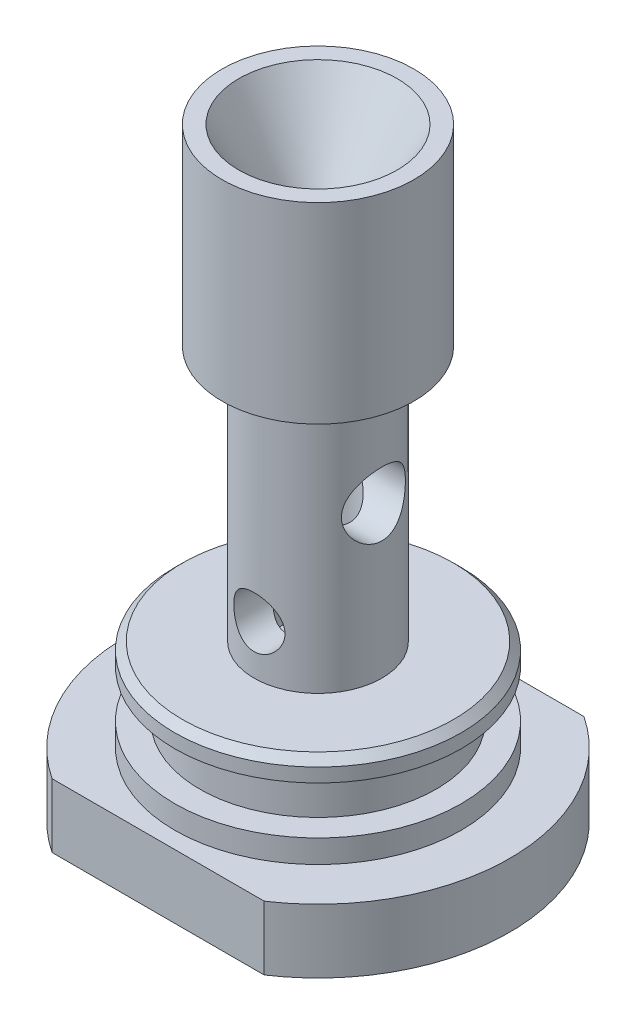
ISO-10303-21;
HEADER;
FILE_DESCRIPTION(('STEP AP214'),'2;1');
FILE_NAME('part.step','',(''),(''),'','','');
FILE_SCHEMA(('AUTOMOTIVE_DESIGN { 1 0 10303 214 1 1 1 1 }'));
ENDSEC;
DATA;
#1=APPLICATION_CONTEXT('core data for automotive mechanical design processes');
#2=APPLICATION_PROTOCOL_DEFINITION('international standard','automotive_design',2000,#1);
#3=PRODUCT_CONTEXT('',#1,'mechanical');
#4=PRODUCT('Part','Part','',(#3));
#5=PRODUCT_RELATED_PRODUCT_CATEGORY('part','',(#4));
#6=PRODUCT_DEFINITION_FORMATION('','',#4);
#7=PRODUCT_DEFINITION_CONTEXT('part definition',#1,'design');
#8=PRODUCT_DEFINITION('design','',#6,#7);
#9=PRODUCT_DEFINITION_SHAPE('','',#8);
#10=(LENGTH_UNIT() NAMED_UNIT(*) SI_UNIT(.MILLI.,.METRE.));
#11=(NAMED_UNIT(*) PLANE_ANGLE_UNIT() SI_UNIT($,.RADIAN.));
#12=(NAMED_UNIT(*) SI_UNIT($,.STERADIAN.) SOLID_ANGLE_UNIT());
#13=UNCERTAINTY_MEASURE_WITH_UNIT(LENGTH_MEASURE(1.E-05),#10,'distance_accuracy_value','');
#14=(GEOMETRIC_REPRESENTATION_CONTEXT(3) GLOBAL_UNCERTAINTY_ASSIGNED_CONTEXT((#13)) GLOBAL_UNIT_ASSIGNED_CONTEXT((#10,
#11,#12)) REPRESENTATION_CONTEXT('',''));
#15=CARTESIAN_POINT('',(0.,0.,0.));
#16=DIRECTION('',(0.,0.,1.));
#17=DIRECTION('',(1.,0.,0.));
#18=AXIS2_PLACEMENT_3D('',#15,#16,#17);
#19=CARTESIAN_POINT('',(0.,0.,0.));
#20=DIRECTION('',(0.,-1.,0.));
#21=DIRECTION('',(0.,0.,-1.));
#22=AXIS2_PLACEMENT_3D('',#19,#20,#21);
#23=PLANE('',#22);
#24=CARTESIAN_POINT('',(0.,0.,0.));
#25=DIRECTION('',(0.,-1.,0.));
#26=DIRECTION('',(0.,0.,-1.));
#27=AXIS2_PLACEMENT_3D('',#24,#25,#26);
#28=CIRCLE('',#27,9.525);
#29=CARTESIAN_POINT('',(5.2651418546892,0.,-7.9375));
#30=VERTEX_POINT('',#29);
#31=CARTESIAN_POINT('',(5.26514185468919,0.,7.9375));
#32=VERTEX_POINT('',#31);
#33=EDGE_CURVE('E94',#30,#32,#28,.T.);
#34=ORIENTED_EDGE('',*,*,#33,.T.);
#35=DIRECTION('',(-1.,0.,0.));
#36=VECTOR('',#35,1.);
#37=CARTESIAN_POINT('',(12.7,0.,7.9375));
#38=LINE('',#37,#36);
#39=CARTESIAN_POINT('',(-5.2651418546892,0.,7.9375));
#40=VERTEX_POINT('',#39);
#41=EDGE_CURVE('E82',#32,#40,#38,.T.);
#42=ORIENTED_EDGE('',*,*,#41,.T.);
#43=CARTESIAN_POINT('',(-5.2651418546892,0.,-7.9375));
#44=VERTEX_POINT('',#43);
#45=EDGE_CURVE('E89',#40,#44,#28,.T.);
#46=ORIENTED_EDGE('',*,*,#45,.T.);
#47=DIRECTION('',(1.,0.,0.));
#48=VECTOR('',#47,1.);
#49=CARTESIAN_POINT('',(0.,0.,-7.9375));
#50=LINE('',#49,#48);
#51=EDGE_CURVE('E74',#44,#30,#50,.T.);
#52=ORIENTED_EDGE('',*,*,#51,.T.);
#53=EDGE_LOOP('',(#34,#42,#46,#52));
#54=FACE_BOUND('',#53,.T.);
#55=ADVANCED_FACE('F31',(#54),#23,.T.);
#56=CARTESIAN_POINT('',(0.,0.,0.));
#57=DIRECTION('',(0.,-1.,0.));
#58=DIRECTION('',(0.,0.,-1.));
#59=AXIS2_PLACEMENT_3D('',#56,#57,#58);
#60=CYLINDRICAL_SURFACE('',#59,9.525);
#61=ORIENTED_EDGE('',*,*,#45,.F.);
#62=DIRECTION('',(0.,-1.,0.));
#63=VECTOR('',#62,1.);
#64=CARTESIAN_POINT('',(-5.2651418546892,0.,7.9375));
#65=LINE('',#64,#63);
#66=CARTESIAN_POINT('',(-5.2651418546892,3.175,7.9375));
#67=VERTEX_POINT('',#66);
#68=EDGE_CURVE('E178',#40,#67,#65,.F.);
#69=ORIENTED_EDGE('',*,*,#68,.T.);
#70=CARTESIAN_POINT('',(0.,3.175,0.));
#71=DIRECTION('',(0.,-1.,0.));
#72=DIRECTION('',(0.,0.,-1.));
#73=AXIS2_PLACEMENT_3D('',#70,#71,#72);
#74=CIRCLE('',#73,9.525);
#75=CARTESIAN_POINT('',(-5.2651418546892,3.175,-7.9375));
#76=VERTEX_POINT('',#75);
#77=EDGE_CURVE('E91',#67,#76,#74,.T.);
#78=ORIENTED_EDGE('',*,*,#77,.T.);
#79=DIRECTION('',(0.,-1.,0.));
#80=VECTOR('',#79,1.);
#81=CARTESIAN_POINT('',(-5.2651418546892,0.,-7.9375));
#82=LINE('',#81,#80);
#83=EDGE_CURVE('E45',#76,#44,#82,.T.);
#84=ORIENTED_EDGE('',*,*,#83,.T.);
#85=EDGE_LOOP('',(#61,#69,#78,#84));
#86=FACE_BOUND('',#85,.T.);
#87=ADVANCED_FACE('F87',(#86),#60,.T.);
#88=CARTESIAN_POINT('',(5.2651418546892,3.175,-7.9375));
#89=VERTEX_POINT('',#88);
#90=CARTESIAN_POINT('',(5.26514185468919,3.175,7.9375));
#91=VERTEX_POINT('',#90);
#92=EDGE_CURVE('E95',#89,#91,#74,.T.);
#93=ORIENTED_EDGE('',*,*,#92,.T.);
#94=DIRECTION('',(0.,-1.,0.));
#95=VECTOR('',#94,1.);
#96=CARTESIAN_POINT('',(5.26514185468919,0.,7.9375));
#97=LINE('',#96,#95);
#98=EDGE_CURVE('E53',#91,#32,#97,.T.);
#99=ORIENTED_EDGE('',*,*,#98,.T.);
#100=ORIENTED_EDGE('',*,*,#33,.F.);
#101=DIRECTION('',(0.,-1.,0.));
#102=VECTOR('',#101,1.);
#103=CARTESIAN_POINT('',(5.2651418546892,0.,-7.9375));
#104=LINE('',#103,#102);
#105=EDGE_CURVE('E77',#30,#89,#104,.F.);
#106=ORIENTED_EDGE('',*,*,#105,.T.);
#107=EDGE_LOOP('',(#93,#99,#100,#106));
#108=FACE_BOUND('',#107,.T.);
#109=ADVANCED_FACE('F184',(#108),#60,.T.);
#110=CARTESIAN_POINT('',(9.525,3.175,0.));
#111=DIRECTION('',(0.,1.,0.));
#112=DIRECTION('',(0.,0.,1.));
#113=AXIS2_PLACEMENT_3D('',#110,#111,#112);
#114=PLANE('',#113);
#115=CARTESIAN_POINT('',(0.,3.175,0.));
#116=DIRECTION('',(0.,-1.,0.));
#117=DIRECTION('',(0.,0.,-1.));
#118=AXIS2_PLACEMENT_3D('',#115,#116,#117);
#119=CIRCLE('',#118,7.112);
#120=CARTESIAN_POINT('',(0.,3.175,-7.112));
#121=VERTEX_POINT('',#120);
#122=EDGE_CURVE('E247',#121,#121,#119,.T.);
#123=ORIENTED_EDGE('',*,*,#122,.T.);
#124=EDGE_LOOP('',(#123));
#125=FACE_BOUND('',#124,.T.);
#126=ORIENTED_EDGE('',*,*,#77,.F.);
#127=DIRECTION('',(1.,0.,0.));
#128=VECTOR('',#127,1.);
#129=CARTESIAN_POINT('',(9.525,3.175,7.9375));
#130=LINE('',#129,#128);
#131=EDGE_CURVE('E12',#67,#91,#130,.T.);
#132=ORIENTED_EDGE('',*,*,#131,.T.);
#133=ORIENTED_EDGE('',*,*,#92,.F.);
#134=DIRECTION('',(-1.,0.,0.));
#135=VECTOR('',#134,1.);
#136=CARTESIAN_POINT('',(9.525,3.175,-7.9375));
#137=LINE('',#136,#135);
#138=EDGE_CURVE('E38',#89,#76,#137,.T.);
#139=ORIENTED_EDGE('',*,*,#138,.T.);
#140=EDGE_LOOP('',(#126,#132,#133,#139));
#141=FACE_BOUND('',#140,.T.);
#142=ADVANCED_FACE('F186',(#125,#141),#114,.T.);
#143=CARTESIAN_POINT('',(0.,0.,0.));
#144=DIRECTION('',(0.,-1.,0.));
#145=DIRECTION('',(0.,0.,-1.));
#146=AXIS2_PLACEMENT_3D('',#143,#144,#145);
#147=CYLINDRICAL_SURFACE('',#146,1.5875);
#148=CARTESIAN_POINT('',(0.,15.24,0.));
#149=DIRECTION('',(0.707106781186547,-0.707106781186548,0.));
#150=DIRECTION('',(-0.707106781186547,-0.707106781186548,0.));
#151=AXIS2_PLACEMENT_3D('',#148,#149,#150);
#152=ELLIPSE('',#151,2.24506403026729,1.5875);
#153=CARTESIAN_POINT('',(0.,15.24,1.5875));
#154=VERTEX_POINT('',#153);
#155=CARTESIAN_POINT('',(0.,15.24,-1.5875));
#156=VERTEX_POINT('',#155);
#157=EDGE_CURVE('E317',#154,#156,#152,.F.);
#158=ORIENTED_EDGE('',*,*,#157,.F.);
#159=CARTESIAN_POINT('',(0.,15.24,0.));
#160=DIRECTION('',(-0.707106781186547,-0.707106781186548,0.));
#161=DIRECTION('',(0.707106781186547,-0.707106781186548,0.));
#162=AXIS2_PLACEMENT_3D('',#159,#160,#161);
#163=ELLIPSE('',#162,2.24506403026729,1.5875);
#164=EDGE_CURVE('E113',#156,#154,#163,.F.);
#165=ORIENTED_EDGE('',*,*,#164,.F.);
#166=EDGE_LOOP('',(#158,#165));
#167=FACE_BOUND('',#166,.T.);
#168=CARTESIAN_POINT('',(0.,25.9079294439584,0.));
#169=DIRECTION('',(0.,1.,0.));
#170=DIRECTION('',(0.,0.,1.));
#171=AXIS2_PLACEMENT_3D('',#168,#169,#170);
#172=CIRCLE('',#171,1.5875);
#173=CARTESIAN_POINT('',(0.,25.9079294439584,1.5875));
#174=VERTEX_POINT('',#173);
#175=EDGE_CURVE('E110',#174,#174,#172,.T.);
#176=ORIENTED_EDGE('',*,*,#175,.T.);
#177=EDGE_LOOP('',(#176));
#178=FACE_BOUND('',#177,.T.);
#179=ADVANCED_FACE('F203',(#167,#178),#147,.F.);
#180=CARTESIAN_POINT('',(0.,0.,0.));
#181=DIRECTION('',(0.,-1.,0.));
#182=DIRECTION('',(0.,0.,-1.));
#183=AXIS2_PLACEMENT_3D('',#180,#181,#182);
#184=CYLINDRICAL_SURFACE('',#183,7.112);
#185=CARTESIAN_POINT('',(0.,4.31796406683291,0.));
#186=DIRECTION('',(0.,-1.,0.));
#187=DIRECTION('',(0.,0.,-1.));
#188=AXIS2_PLACEMENT_3D('',#185,#186,#187);
#189=CIRCLE('',#188,7.112);
#190=CARTESIAN_POINT('',(0.,4.31796406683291,-7.112));
#191=VERTEX_POINT('',#190);
#192=EDGE_CURVE('E245',#191,#191,#189,.T.);
#193=ORIENTED_EDGE('',*,*,#192,.T.);
#194=EDGE_LOOP('',(#193));
#195=FACE_BOUND('',#194,.T.);
#196=ORIENTED_EDGE('',*,*,#122,.F.);
#197=EDGE_LOOP('',(#196));
#198=FACE_BOUND('',#197,.T.);
#199=ADVANCED_FACE('F205',(#195,#198),#184,.T.);
#200=CARTESIAN_POINT('',(7.112,4.31796406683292,0.));
#201=DIRECTION('',(0.,1.,0.));
#202=DIRECTION('',(0.,0.,1.));
#203=AXIS2_PLACEMENT_3D('',#200,#201,#202);
#204=PLANE('',#203);
#205=CARTESIAN_POINT('',(0.,4.31796406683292,0.));
#206=DIRECTION('',(0.,-1.,0.));
#207=DIRECTION('',(0.,0.,-1.));
#208=AXIS2_PLACEMENT_3D('',#205,#206,#207);
#209=CIRCLE('',#208,5.8674);
#210=CARTESIAN_POINT('',(0.,4.31796406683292,-5.8674));
#211=VERTEX_POINT('',#210);
#212=EDGE_CURVE('E236',#211,#211,#209,.T.);
#213=ORIENTED_EDGE('',*,*,#212,.T.);
#214=EDGE_LOOP('',(#213));
#215=FACE_BOUND('',#214,.T.);
#216=ORIENTED_EDGE('',*,*,#192,.F.);
#217=EDGE_LOOP('',(#216));
#218=FACE_BOUND('',#217,.T.);
#219=ADVANCED_FACE('F208',(#215,#218),#204,.T.);
#220=CARTESIAN_POINT('',(0.,0.,0.));
#221=DIRECTION('',(0.,-1.,0.));
#222=DIRECTION('',(0.,0.,-1.));
#223=AXIS2_PLACEMENT_3D('',#220,#221,#222);
#224=CYLINDRICAL_SURFACE('',#223,5.8674);
#225=CARTESIAN_POINT('',(0.,6.68016406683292,0.));
#226=DIRECTION('',(0.,-1.,0.));
#227=DIRECTION('',(0.,0.,-1.));
#228=AXIS2_PLACEMENT_3D('',#225,#226,#227);
#229=CIRCLE('',#228,5.8674);
#230=CARTESIAN_POINT('',(0.,6.68016406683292,-5.8674));
#231=VERTEX_POINT('',#230);
#232=EDGE_CURVE('E232',#231,#231,#229,.T.);
#233=ORIENTED_EDGE('',*,*,#232,.T.);
#234=EDGE_LOOP('',(#233));
#235=FACE_BOUND('',#234,.T.);
#236=ORIENTED_EDGE('',*,*,#212,.F.);
#237=EDGE_LOOP('',(#236));
#238=FACE_BOUND('',#237,.T.);
#239=ADVANCED_FACE('F212',(#235,#238),#224,.T.);
#240=CARTESIAN_POINT('',(5.8674,6.68016406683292,0.));
#241=DIRECTION('',(0.,-1.,0.));
#242=DIRECTION('',(0.,0.,-1.));
#243=AXIS2_PLACEMENT_3D('',#240,#241,#242);
#244=PLANE('',#243);
#245=CARTESIAN_POINT('',(0.,6.68016406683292,0.));
#246=DIRECTION('',(0.,-1.,0.));
#247=DIRECTION('',(0.,0.,-1.));
#248=AXIS2_PLACEMENT_3D('',#245,#246,#247);
#249=CIRCLE('',#248,7.112);
#250=CARTESIAN_POINT('',(0.,6.68016406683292,-7.112));
#251=VERTEX_POINT('',#250);
#252=EDGE_CURVE('E231',#251,#251,#249,.T.);
#253=ORIENTED_EDGE('',*,*,#252,.T.);
#254=EDGE_LOOP('',(#253));
#255=FACE_BOUND('',#254,.T.);
#256=ORIENTED_EDGE('',*,*,#232,.F.);
#257=EDGE_LOOP('',(#256));
#258=FACE_BOUND('',#257,.T.);
#259=ADVANCED_FACE('F216',(#255,#258),#244,.T.);
#260=CARTESIAN_POINT('',(0.,0.,0.));
#261=DIRECTION('',(0.,-1.,0.));
#262=DIRECTION('',(0.,0.,-1.));
#263=AXIS2_PLACEMENT_3D('',#260,#261,#262);
#264=CYLINDRICAL_SURFACE('',#263,7.112);
#265=CARTESIAN_POINT('',(0.,7.36592944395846,0.));
#266=DIRECTION('',(0.,1.,0.));
#267=DIRECTION('',(0.,0.,1.));
#268=AXIS2_PLACEMENT_3D('',#265,#266,#267);
#269=CIRCLE('',#268,7.112);
#270=CARTESIAN_POINT('',(0.,7.36592944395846,7.112));
#271=VERTEX_POINT('',#270);
#272=EDGE_CURVE('E97',#271,#271,#269,.F.);
#273=ORIENTED_EDGE('',*,*,#272,.T.);
#274=EDGE_LOOP('',(#273));
#275=FACE_BOUND('',#274,.T.);
#276=ORIENTED_EDGE('',*,*,#252,.F.);
#277=EDGE_LOOP('',(#276));
#278=FACE_BOUND('',#277,.T.);
#279=ADVANCED_FACE('F219',(#275,#278),#264,.T.);
#280=CARTESIAN_POINT('',(7.112,7.74692944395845,0.));
#281=DIRECTION('',(0.,1.,0.));
#282=DIRECTION('',(0.,0.,1.));
#283=AXIS2_PLACEMENT_3D('',#280,#281,#282);
#284=PLANE('',#283);
#285=CARTESIAN_POINT('',(0.,7.74692944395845,0.));
#286=DIRECTION('',(0.,1.,0.));
#287=DIRECTION('',(0.,0.,1.));
#288=AXIS2_PLACEMENT_3D('',#285,#286,#287);
#289=CIRCLE('',#288,6.731);
#290=CARTESIAN_POINT('',(0.,7.74692944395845,6.731));
#291=VERTEX_POINT('',#290);
#292=EDGE_CURVE('E104',#291,#291,#289,.T.);
#293=ORIENTED_EDGE('',*,*,#292,.T.);
#294=EDGE_LOOP('',(#293));
#295=FACE_BOUND('',#294,.T.);
#296=CARTESIAN_POINT('',(0.,7.74692944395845,0.));
#297=DIRECTION('',(0.,-1.,0.));
#298=DIRECTION('',(0.,0.,-1.));
#299=AXIS2_PLACEMENT_3D('',#296,#297,#298);
#300=CIRCLE('',#299,3.175);
#301=CARTESIAN_POINT('',(0.,7.74692944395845,-3.175));
#302=VERTEX_POINT('',#301);
#303=EDGE_CURVE('E233',#302,#302,#300,.T.);
#304=ORIENTED_EDGE('',*,*,#303,.T.);
#305=EDGE_LOOP('',(#304));
#306=FACE_BOUND('',#305,.T.);
#307=ADVANCED_FACE('F166',(#295,#306),#284,.T.);
#308=CARTESIAN_POINT('',(0.,0.,0.));
#309=DIRECTION('',(0.,-1.,0.));
#310=DIRECTION('',(0.,0.,-1.));
#311=AXIS2_PLACEMENT_3D('',#308,#309,#310);
#312=CYLINDRICAL_SURFACE('',#311,3.175);
#313=CARTESIAN_POINT('',(-2.74963065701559,15.24,-1.5875));
#314=CARTESIAN_POINT('',(-2.74963786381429,15.15727885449,-1.58749422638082));
#315=CARTESIAN_POINT('',(-2.75342034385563,15.074453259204,-1.58099120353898));
#316=CARTESIAN_POINT('',(-2.76800256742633,14.911344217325,-1.55531059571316));
#317=CARTESIAN_POINT('',(-2.77881705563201,14.8310664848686,-1.53610637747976));
#318=CARTESIAN_POINT('',(-2.8058958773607,14.675720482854,-1.48605866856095));
#319=CARTESIAN_POINT('',(-2.82213119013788,14.6006269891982,-1.4552770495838));
#320=CARTESIAN_POINT('',(-2.85817730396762,14.4566890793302,-1.38313719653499));
#321=CARTESIAN_POINT('',(-2.87798829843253,14.3878450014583,-1.34177839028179));
#322=CARTESIAN_POINT('',(-2.92095029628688,14.252089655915,-1.24565813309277));
#323=CARTESIAN_POINT('',(-2.94424201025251,14.1858061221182,-1.19007260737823));
#324=CARTESIAN_POINT('',(-2.99040522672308,14.0630141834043,-1.06879041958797));
#325=CARTESIAN_POINT('',(-3.01327651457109,14.0065106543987,-1.00308874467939));
#326=CARTESIAN_POINT('',(-3.05786594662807,13.9011546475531,-0.858027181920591));
#327=CARTESIAN_POINT('',(-3.07940243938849,13.853074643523,-0.778045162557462));
#328=CARTESIAN_POINT('',(-3.11706825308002,13.7713388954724,-0.609849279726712));
#329=CARTESIAN_POINT('',(-3.1332009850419,13.7376740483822,-0.52164065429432));
#330=CARTESIAN_POINT('',(-3.15722732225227,13.6882113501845,-0.346146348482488));
#331=CARTESIAN_POINT('',(-3.16562549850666,13.6713126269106,-0.259241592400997));
#332=CARTESIAN_POINT('',(-3.17512039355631,13.6522362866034,-0.0834558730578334));
#333=CARTESIAN_POINT('',(-3.17622153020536,13.6500497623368,0.0054238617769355));
#334=CARTESIAN_POINT('',(-3.17123733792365,13.6600353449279,0.174359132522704));
#335=CARTESIAN_POINT('',(-3.16576862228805,13.6709753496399,0.254509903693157));
#336=CARTESIAN_POINT('',(-3.14919114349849,13.7046983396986,0.411660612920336));
#337=CARTESIAN_POINT('',(-3.138081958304,13.7274822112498,0.488660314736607));
#338=CARTESIAN_POINT('',(-3.11104888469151,13.7843935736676,0.638666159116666));
#339=CARTESIAN_POINT('',(-3.09506050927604,13.8186736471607,0.711602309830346));
#340=CARTESIAN_POINT('',(-3.05971013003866,13.8973931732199,0.850863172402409));
#341=CARTESIAN_POINT('',(-3.04034691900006,13.9418362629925,0.91718550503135));
#342=CARTESIAN_POINT('',(-2.99790476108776,14.0444463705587,1.04802568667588));
#343=CARTESIAN_POINT('',(-2.97464759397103,14.1035135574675,1.11178034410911));
#344=CARTESIAN_POINT('',(-2.92821265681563,14.2312861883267,1.22889068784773));
#345=CARTESIAN_POINT('',(-2.90503496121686,14.2999989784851,1.28223837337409));
#346=CARTESIAN_POINT('',(-2.85978847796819,14.4504540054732,1.38033971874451));
#347=CARTESIAN_POINT('',(-2.83788357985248,14.5327465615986,1.42433248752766));
#348=CARTESIAN_POINT('',(-2.79996027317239,14.7049135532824,1.49751909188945));
#349=CARTESIAN_POINT('',(-2.78393572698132,14.7947799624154,1.52672836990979));
#350=CARTESIAN_POINT('',(-2.76137109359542,14.9720530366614,1.56714858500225));
#351=CARTESIAN_POINT('',(-2.75418003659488,15.0590902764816,1.57960238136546));
#352=CARTESIAN_POINT('',(-2.74824696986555,15.2342871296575,1.58990815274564));
#353=CARTESIAN_POINT('',(-2.74949899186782,15.3224459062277,1.5877704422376));
#354=CARTESIAN_POINT('',(-2.75962009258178,15.4871005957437,1.57009471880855));
#355=CARTESIAN_POINT('',(-2.76764095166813,15.5638173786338,1.55604815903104));
#356=CARTESIAN_POINT('',(-2.78914259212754,15.7136588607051,1.517167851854));
#357=CARTESIAN_POINT('',(-2.80262514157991,15.7867823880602,1.49233061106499));
#358=CARTESIAN_POINT('',(-2.83426252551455,15.931215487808,1.43136554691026));
#359=CARTESIAN_POINT('',(-2.85260483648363,16.002284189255,1.3947680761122));
#360=CARTESIAN_POINT('',(-2.89172839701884,16.1376824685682,1.31173071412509));
#361=CARTESIAN_POINT('',(-2.91251089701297,16.2020085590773,1.26528576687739));
#362=CARTESIAN_POINT('',(-2.95732197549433,16.3305787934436,1.15702900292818));
#363=CARTESIAN_POINT('',(-2.98142950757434,16.3937904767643,1.09401811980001));
#364=CARTESIAN_POINT('',(-3.02790598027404,16.5090669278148,0.957904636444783));
#365=CARTESIAN_POINT('',(-3.05027433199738,16.561127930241,0.884798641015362));
#366=CARTESIAN_POINT('',(-3.09151911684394,16.6537857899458,0.727924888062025));
#367=CARTESIAN_POINT('',(-3.11028781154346,16.6940438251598,0.643926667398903));
#368=CARTESIAN_POINT('',(-3.1413982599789,16.7594564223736,0.469141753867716));
#369=CARTESIAN_POINT('',(-3.15374565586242,16.784624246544,0.378361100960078));
#370=CARTESIAN_POINT('',(-3.16972169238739,16.8169725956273,0.201580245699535));
#371=CARTESIAN_POINT('',(-3.17404635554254,16.8255916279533,0.115905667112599));
#372=CARTESIAN_POINT('',(-3.17566881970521,16.8288386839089,-0.0557625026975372));
#373=CARTESIAN_POINT('',(-3.17296908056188,16.8234716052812,-0.141755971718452));
#374=CARTESIAN_POINT('',(-3.16125175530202,16.7998514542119,-0.305654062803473));
#375=CARTESIAN_POINT('',(-3.15266220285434,16.7824708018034,-0.383718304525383));
#376=CARTESIAN_POINT('',(-3.13042448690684,16.7364933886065,-0.535695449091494));
#377=CARTESIAN_POINT('',(-3.11677559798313,16.7078950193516,-0.609607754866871));
#378=CARTESIAN_POINT('',(-3.08492415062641,16.6390208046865,-0.754734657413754));
#379=CARTESIAN_POINT('',(-3.06655179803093,16.5982978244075,-0.825698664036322));
#380=CARTESIAN_POINT('',(-3.02717411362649,16.5068917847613,-0.960079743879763));
#381=CARTESIAN_POINT('',(-3.00616757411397,16.4562041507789,-1.02349332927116));
#382=CARTESIAN_POINT('',(-2.96114168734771,16.3404595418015,-1.14762598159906));
#383=CARTESIAN_POINT('',(-2.9370305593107,16.27447455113,-1.20744882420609));
#384=CARTESIAN_POINT('',(-2.89025133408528,16.1330469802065,-1.31550296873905));
#385=CARTESIAN_POINT('',(-2.86758452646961,16.0575961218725,-1.36372401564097));
#386=CARTESIAN_POINT('',(-2.82574373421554,15.8962143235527,-1.44848433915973));
#387=CARTESIAN_POINT('',(-2.80670276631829,15.8100275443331,-1.48460629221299));
#388=CARTESIAN_POINT('',(-2.77600023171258,15.6315848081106,-1.54126995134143));
#389=CARTESIAN_POINT('',(-2.76431400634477,15.5393502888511,-1.56186376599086));
#390=CARTESIAN_POINT('',(-2.75477720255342,15.4117589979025,-1.57855762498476));
#391=CARTESIAN_POINT('',(-2.75285404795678,15.3775284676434,-1.58190581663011));
#392=CARTESIAN_POINT('',(-2.75027923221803,15.3088713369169,-1.58637828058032));
#393=CARTESIAN_POINT('',(-2.74962765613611,15.2744447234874,-1.5875024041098));
#394=CARTESIAN_POINT('',(-2.74963065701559,15.24,-1.5875));
#395=B_SPLINE_CURVE_WITH_KNOTS('',3,(#313,#314,#315,#316,#317,#318,#319,#320,#321,#322,#323,
#324,#325,#326,#327,#328,#329,#330,#331,#332,#333,#334,#335,#336,#337,#338,#339,#340,#341,#342,
#343,#344,#345,#346,#347,#348,#349,#350,#351,#352,#353,#354,#355,#356,#357,#358,#359,#360,#361,
#362,#363,#364,#365,#366,#367,#368,#369,#370,#371,#372,#373,#374,#375,#376,#377,#378,#379,#380,
#381,#382,#383,#384,#385,#386,#387,#388,#389,#390,#391,#392,#393,#394),.UNSPECIFIED.,.T.,.F.,(4,
2,2,2,2,2,2,2,2,2,2,2,2,2,2,2,2,2,2,2,2,2,2,2,2,2,2,2,2,2,2,2,2,2,2,2,2,2,2,2,4),(0.,
0.248018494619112,0.496558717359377,0.743789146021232,0.991032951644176,1.25866892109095,
1.52643794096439,1.81225653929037,2.09789437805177,2.36320782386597,2.62836062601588,
2.87045554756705,3.1125685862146,3.35803136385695,3.60358212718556,3.87234416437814,
4.14131201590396,4.42736036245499,4.71310929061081,4.97621386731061,5.23913247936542,
5.47329016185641,5.7075237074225,5.95260583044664,6.19781409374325,6.47393205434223,
6.75014310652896,7.03364387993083,7.31689512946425,7.5741572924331,7.8313293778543,
8.07155524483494,8.3118155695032,8.56235191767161,8.81300355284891,9.08860008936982,
9.36443934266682,9.64899564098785,9.93259273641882,10.0358596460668,10.1391334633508),.UNSPECIFIED.);
#396=CARTESIAN_POINT('',(-2.74963065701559,15.24,-1.5875));
#397=VERTEX_POINT('',#396);
#398=EDGE_CURVE('E122',#397,#397,#395,.T.);
#399=ORIENTED_EDGE('',*,*,#398,.F.);
#400=EDGE_LOOP('',(#399));
#401=FACE_BOUND('',#400,.T.);
#402=CARTESIAN_POINT('',(2.74963065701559,15.24,-1.5875));
#403=CARTESIAN_POINT('',(2.74963786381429,15.32272114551,-1.58749422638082));
#404=CARTESIAN_POINT('',(2.75342034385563,15.405546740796,-1.58099120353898));
#405=CARTESIAN_POINT('',(2.76800256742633,15.568655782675,-1.55531059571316));
#406=CARTESIAN_POINT('',(2.77881705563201,15.6489335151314,-1.53610637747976));
#407=CARTESIAN_POINT('',(2.8058958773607,15.804279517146,-1.48605866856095));
#408=CARTESIAN_POINT('',(2.82213119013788,15.8793730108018,-1.4552770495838));
#409=CARTESIAN_POINT('',(2.85817730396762,16.0233109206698,-1.38313719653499));
#410=CARTESIAN_POINT('',(2.87798829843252,16.0921549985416,-1.34177839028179));
#411=CARTESIAN_POINT('',(2.92095029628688,16.227910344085,-1.24565813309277));
#412=CARTESIAN_POINT('',(2.94424201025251,16.2941938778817,-1.19007260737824));
#413=CARTESIAN_POINT('',(2.99040522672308,16.4169858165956,-1.06879041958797));
#414=CARTESIAN_POINT('',(3.01327651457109,16.4734893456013,-1.00308874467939));
#415=CARTESIAN_POINT('',(3.05786594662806,16.5788453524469,-0.858027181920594));
#416=CARTESIAN_POINT('',(3.07940243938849,16.626925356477,-0.778045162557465));
#417=CARTESIAN_POINT('',(3.11706825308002,16.7086611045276,-0.609849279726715));
#418=CARTESIAN_POINT('',(3.1332009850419,16.7423259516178,-0.521640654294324));
#419=CARTESIAN_POINT('',(3.15722732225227,16.7917886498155,-0.346146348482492));
#420=CARTESIAN_POINT('',(3.16562549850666,16.8086873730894,-0.259241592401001));
#421=CARTESIAN_POINT('',(3.17512039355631,16.8277637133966,-0.0834558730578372));
#422=CARTESIAN_POINT('',(3.17622153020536,16.8299502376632,0.00542386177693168));
#423=CARTESIAN_POINT('',(3.17123733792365,16.8199646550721,0.1743591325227));
#424=CARTESIAN_POINT('',(3.16576862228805,16.8090246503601,0.254509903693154));
#425=CARTESIAN_POINT('',(3.14919114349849,16.7753016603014,0.411660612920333));
#426=CARTESIAN_POINT('',(3.138081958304,16.7525177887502,0.488660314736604));
#427=CARTESIAN_POINT('',(3.11104888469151,16.6956064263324,0.638666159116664));
#428=CARTESIAN_POINT('',(3.09506050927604,16.6613263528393,0.711602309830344));
#429=CARTESIAN_POINT('',(3.05971013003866,16.5826068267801,0.850863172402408));
#430=CARTESIAN_POINT('',(3.04034691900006,16.5381637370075,0.917185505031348));
#431=CARTESIAN_POINT('',(2.99790476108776,16.4355536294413,1.04802568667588));
#432=CARTESIAN_POINT('',(2.97464759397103,16.3764864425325,1.11178034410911));
#433=CARTESIAN_POINT('',(2.92821265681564,16.2487138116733,1.22889068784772));
#434=CARTESIAN_POINT('',(2.90503496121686,16.1800010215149,1.28223837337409));
#435=CARTESIAN_POINT('',(2.85978847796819,16.0295459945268,1.38033971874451));
#436=CARTESIAN_POINT('',(2.83788357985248,15.9472534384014,1.42433248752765));
#437=CARTESIAN_POINT('',(2.79996027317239,15.7750864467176,1.49751909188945));
#438=CARTESIAN_POINT('',(2.78393572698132,15.6852200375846,1.52672836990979));
#439=CARTESIAN_POINT('',(2.76137109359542,15.5079469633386,1.56714858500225));
#440=CARTESIAN_POINT('',(2.75418003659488,15.4209097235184,1.57960238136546));
#441=CARTESIAN_POINT('',(2.74824696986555,15.2457128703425,1.58990815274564));
#442=CARTESIAN_POINT('',(2.74949899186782,15.1575540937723,1.5877704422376));
#443=CARTESIAN_POINT('',(2.75962009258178,14.9928994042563,1.57009471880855));
#444=CARTESIAN_POINT('',(2.76764095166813,14.9161826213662,1.55604815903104));
#445=CARTESIAN_POINT('',(2.78914259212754,14.7663411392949,1.517167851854));
#446=CARTESIAN_POINT('',(2.80262514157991,14.6932176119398,1.49233061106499));
#447=CARTESIAN_POINT('',(2.83426252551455,14.548784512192,1.43136554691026));
#448=CARTESIAN_POINT('',(2.85260483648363,14.477715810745,1.3947680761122));
#449=CARTESIAN_POINT('',(2.89172839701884,14.3423175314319,1.31173071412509));
#450=CARTESIAN_POINT('',(2.91251089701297,14.2779914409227,1.2652857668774));
#451=CARTESIAN_POINT('',(2.95732197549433,14.1494212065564,1.15702900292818));
#452=CARTESIAN_POINT('',(2.98142950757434,14.0862095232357,1.09401811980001));
#453=CARTESIAN_POINT('',(3.02790598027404,13.9709330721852,0.957904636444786));
#454=CARTESIAN_POINT('',(3.05027433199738,13.918872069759,0.884798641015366));
#455=CARTESIAN_POINT('',(3.09151911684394,13.8262142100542,0.727924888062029));
#456=CARTESIAN_POINT('',(3.11028781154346,13.7859561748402,0.643926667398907));
#457=CARTESIAN_POINT('',(3.1413982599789,13.7205435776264,0.469141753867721));
#458=CARTESIAN_POINT('',(3.15374565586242,13.695375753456,0.378361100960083));
#459=CARTESIAN_POINT('',(3.16972169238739,13.6630274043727,0.201580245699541));
#460=CARTESIAN_POINT('',(3.17404635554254,13.6544083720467,0.115905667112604));
#461=CARTESIAN_POINT('',(3.17566881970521,13.6511613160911,-0.0557625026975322));
#462=CARTESIAN_POINT('',(3.17296908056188,13.6565283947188,-0.141755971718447));
#463=CARTESIAN_POINT('',(3.16125175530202,13.6801485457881,-0.305654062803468));
#464=CARTESIAN_POINT('',(3.15266220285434,13.6975291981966,-0.383718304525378));
#465=CARTESIAN_POINT('',(3.13042448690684,13.7435066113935,-0.53569544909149));
#466=CARTESIAN_POINT('',(3.11677559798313,13.7721049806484,-0.609607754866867));
#467=CARTESIAN_POINT('',(3.08492415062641,13.8409791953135,-0.754734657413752));
#468=CARTESIAN_POINT('',(3.06655179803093,13.8817021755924,-0.825698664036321));
#469=CARTESIAN_POINT('',(3.02717411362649,13.9731082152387,-0.960079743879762));
#470=CARTESIAN_POINT('',(3.00616757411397,14.0237958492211,-1.02349332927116));
#471=CARTESIAN_POINT('',(2.96114168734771,14.1395404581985,-1.14762598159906));
#472=CARTESIAN_POINT('',(2.93703055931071,14.20552544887,-1.20744882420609));
#473=CARTESIAN_POINT('',(2.89025133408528,14.3469530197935,-1.31550296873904));
#474=CARTESIAN_POINT('',(2.86758452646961,14.4224038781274,-1.36372401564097));
#475=CARTESIAN_POINT('',(2.82574373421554,14.5837856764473,-1.44848433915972));
#476=CARTESIAN_POINT('',(2.80670276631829,14.6699724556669,-1.48460629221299));
#477=CARTESIAN_POINT('',(2.77600023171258,14.8484151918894,-1.54126995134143));
#478=CARTESIAN_POINT('',(2.76431400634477,14.9406497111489,-1.56186376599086));
#479=CARTESIAN_POINT('',(2.75477720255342,15.0682410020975,-1.57855762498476));
#480=CARTESIAN_POINT('',(2.75285404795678,15.1024715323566,-1.58190581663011));
#481=CARTESIAN_POINT('',(2.75027923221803,15.1711286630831,-1.58637828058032));
#482=CARTESIAN_POINT('',(2.74962765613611,15.2055552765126,-1.5875024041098));
#483=CARTESIAN_POINT('',(2.74963065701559,15.24,-1.5875));
#484=B_SPLINE_CURVE_WITH_KNOTS('',3,(#402,#403,#404,#405,#406,#407,#408,#409,#410,#411,#412,
#413,#414,#415,#416,#417,#418,#419,#420,#421,#422,#423,#424,#425,#426,#427,#428,#429,#430,#431,
#432,#433,#434,#435,#436,#437,#438,#439,#440,#441,#442,#443,#444,#445,#446,#447,#448,#449,#450,
#451,#452,#453,#454,#455,#456,#457,#458,#459,#460,#461,#462,#463,#464,#465,#466,#467,#468,#469,
#470,#471,#472,#473,#474,#475,#476,#477,#478,#479,#480,#481,#482,#483),.UNSPECIFIED.,.T.,.F.,(4,
2,2,2,2,2,2,2,2,2,2,2,2,2,2,2,2,2,2,2,2,2,2,2,2,2,2,2,2,2,2,2,2,2,2,2,2,2,2,2,4),(0.,
0.248018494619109,0.496558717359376,0.743789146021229,0.991032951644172,1.25866892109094,
1.52643794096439,1.81225653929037,2.09789437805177,2.36320782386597,2.62836062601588,
2.87045554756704,3.1125685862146,3.35803136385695,3.60358212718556,3.87234416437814,
4.14131201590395,4.42736036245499,4.71310929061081,4.9762138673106,5.23913247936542,
5.4732901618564,5.7075237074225,5.95260583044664,6.19781409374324,6.47393205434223,
6.75014310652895,7.03364387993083,7.31689512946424,7.5741572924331,7.83132937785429,
8.07155524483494,8.3118155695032,8.56235191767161,8.81300355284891,9.08860008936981,
9.36443934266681,9.64899564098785,9.93259273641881,10.0358596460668,10.1391334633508),.UNSPECIFIED.);
#485=CARTESIAN_POINT('',(2.74963065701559,15.24,-1.5875));
#486=VERTEX_POINT('',#485);
#487=EDGE_CURVE('E173',#486,#486,#484,.T.);
#488=ORIENTED_EDGE('',*,*,#487,.F.);
#489=EDGE_LOOP('',(#488));
#490=FACE_BOUND('',#489,.T.);
#491=CARTESIAN_POINT('',(0.,11.43,-3.175));
#492=CARTESIAN_POINT('',(0.0682580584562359,11.4299937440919,-3.17499537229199));
#493=CARTESIAN_POINT('',(0.136634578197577,11.4244642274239,-3.17277301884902));
#494=CARTESIAN_POINT('',(0.271460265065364,11.402537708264,-3.16409992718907));
#495=CARTESIAN_POINT('',(0.337903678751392,11.3861111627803,-3.15763769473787));
#496=CARTESIAN_POINT('',(0.466695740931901,11.3430836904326,-3.1411812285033));
#497=CARTESIAN_POINT('',(0.529057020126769,11.3165160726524,-3.13119856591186));
#498=CARTESIAN_POINT('',(0.648380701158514,11.2540928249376,-3.1086844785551));
#499=CARTESIAN_POINT('',(0.70534496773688,11.2182404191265,-3.09615393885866));
#500=CARTESIAN_POINT('',(0.8150231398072,11.1364804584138,-3.06915112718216));
#501=CARTESIAN_POINT('',(0.867449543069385,11.0902072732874,-3.05461858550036));
#502=CARTESIAN_POINT('',(0.964041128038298,10.9896909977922,-3.02552466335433));
#503=CARTESIAN_POINT('',(1.00820226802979,10.9354440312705,-3.01096327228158));
#504=CARTESIAN_POINT('',(1.08894535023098,10.8175881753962,-2.98273972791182));
#505=CARTESIAN_POINT('',(1.12510251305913,10.7536700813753,-2.96914643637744));
#506=CARTESIAN_POINT('',(1.18602424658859,10.6200343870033,-2.94534365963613));
#507=CARTESIAN_POINT('',(1.21079422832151,10.5503195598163,-2.93513256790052));
#508=CARTESIAN_POINT('',(1.24707575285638,10.410372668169,-2.9198973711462));
#509=CARTESIAN_POINT('',(1.25913766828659,10.3403074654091,-2.91465901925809));
#510=CARTESIAN_POINT('',(1.27137983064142,10.1989667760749,-2.90934142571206));
#511=CARTESIAN_POINT('',(1.2715659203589,10.1276919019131,-2.90925964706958));
#512=CARTESIAN_POINT('',(1.26046824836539,9.99124451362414,-2.91408167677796));
#513=CARTESIAN_POINT('',(1.24998182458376,9.92599252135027,-2.91863891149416));
#514=CARTESIAN_POINT('',(1.21916626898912,9.79826618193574,-2.93164379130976));
#515=CARTESIAN_POINT('',(1.19883541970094,9.73579232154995,-2.94009211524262));
#516=CARTESIAN_POINT('',(1.14852115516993,9.61388867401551,-2.96011273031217));
#517=CARTESIAN_POINT('',(1.11834921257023,9.55454703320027,-2.971745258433));
#518=CARTESIAN_POINT('',(1.04934160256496,9.44155095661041,-2.9968070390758));
#519=CARTESIAN_POINT('',(1.01050268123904,9.38789866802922,-3.01023696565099));
#520=CARTESIAN_POINT('',(0.921734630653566,9.28343982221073,-3.03864477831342));
#521=CARTESIAN_POINT('',(0.871180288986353,9.23317385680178,-3.05366207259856));
#522=CARTESIAN_POINT('',(0.762199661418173,9.14166035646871,-3.08266988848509));
#523=CARTESIAN_POINT('',(0.703771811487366,9.10041461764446,-3.09666020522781));
#524=CARTESIAN_POINT('',(0.57916930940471,9.02740292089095,-3.12238822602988));
#525=CARTESIAN_POINT('',(0.512864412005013,8.99584035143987,-3.13407596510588));
#526=CARTESIAN_POINT('',(0.37530009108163,8.94450340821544,-3.15350415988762));
#527=CARTESIAN_POINT('',(0.304043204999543,8.92472304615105,-3.16124662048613));
#528=CARTESIAN_POINT('',(0.163128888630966,8.89860533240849,-3.17154648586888));
#529=CARTESIAN_POINT('',(0.0936264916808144,8.89154149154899,-3.17438370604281));
#530=CARTESIAN_POINT('',(-0.045621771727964,8.88891218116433,-3.17543483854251));
#531=CARTESIAN_POINT('',(-0.115367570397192,8.89334373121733,-3.17364994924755));
#532=CARTESIAN_POINT('',(-0.249829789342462,8.91304526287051,-3.16584055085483));
#533=CARTESIAN_POINT('',(-0.314631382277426,8.92781931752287,-3.16001013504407));
#534=CARTESIAN_POINT('',(-0.440775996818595,8.96711167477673,-3.14489745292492));
#535=CARTESIAN_POINT('',(-0.502118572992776,8.99163122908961,-3.13561474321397));
#536=CARTESIAN_POINT('',(-0.621715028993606,9.05051843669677,-3.11414537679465));
#537=CARTESIAN_POINT('',(-0.679817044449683,9.0851643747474,-3.10187858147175));
#538=CARTESIAN_POINT('',(-0.789586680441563,9.16301210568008,-3.07577086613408));
#539=CARTESIAN_POINT('',(-0.841251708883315,9.20621732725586,-3.06192931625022));
#540=CARTESIAN_POINT('',(-0.9402591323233,9.30330245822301,-3.03304649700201));
#541=CARTESIAN_POINT('',(-0.987090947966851,9.35769879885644,-3.01798635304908));
#542=CARTESIAN_POINT('',(-1.07108701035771,9.47384445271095,-2.98920962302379));
#543=CARTESIAN_POINT('',(-1.10824966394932,9.53559497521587,-2.97549325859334));
#544=CARTESIAN_POINT('',(-1.17208776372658,9.66562817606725,-2.95093580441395));
#545=CARTESIAN_POINT('',(-1.19865812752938,9.73396833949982,-2.9401238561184));
#546=CARTESIAN_POINT('',(-1.23970809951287,9.87471586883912,-2.92305532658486));
#547=CARTESIAN_POINT('',(-1.25419663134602,9.94712019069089,-2.91679538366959));
#548=CARTESIAN_POINT('',(-1.26981941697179,10.0883262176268,-2.91002567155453));
#549=CARTESIAN_POINT('',(-1.27183964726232,10.1570122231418,-2.90913452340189));
#550=CARTESIAN_POINT('',(-1.26479500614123,10.2936959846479,-2.91220420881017));
#551=CARTESIAN_POINT('',(-1.25573154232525,10.3616938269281,-2.91616442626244));
#552=CARTESIAN_POINT('',(-1.22750031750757,10.492315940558,-2.92815422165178));
#553=CARTESIAN_POINT('',(-1.20874630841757,10.555046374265,-2.9360166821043));
#554=CARTESIAN_POINT('',(-1.16205345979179,10.6764954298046,-2.95480740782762));
#555=CARTESIAN_POINT('',(-1.13411208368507,10.7352129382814,-2.96573651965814));
#556=CARTESIAN_POINT('',(-1.06798920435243,10.8506321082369,-2.99020617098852));
#557=CARTESIAN_POINT('',(-1.02931298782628,10.9070258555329,-3.00386040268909));
#558=CARTESIAN_POINT('',(-0.9435414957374,11.0128007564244,-3.03189515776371));
#559=CARTESIAN_POINT('',(-0.896443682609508,11.0621797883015,-3.04627589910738));
#560=CARTESIAN_POINT('',(-0.791530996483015,11.1558088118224,-3.07526415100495));
#561=CARTESIAN_POINT('',(-0.733219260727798,11.1995186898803,-3.08982591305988));
#562=CARTESIAN_POINT('',(-0.60953670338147,11.2765440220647,-3.1165825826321));
#563=CARTESIAN_POINT('',(-0.544162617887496,11.3098546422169,-3.12877638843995));
#564=CARTESIAN_POINT('',(-0.409408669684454,11.3643551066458,-3.14921718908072));
#565=CARTESIAN_POINT('',(-0.340126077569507,11.3857591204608,-3.15753345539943));
#566=CARTESIAN_POINT('',(-0.198676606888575,11.416435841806,-3.16956634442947));
#567=CARTESIAN_POINT('',(-0.12651963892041,11.4257470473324,-3.1732975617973));
#568=CARTESIAN_POINT('',(-0.0361393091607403,11.4296160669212,-3.17484696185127));
#569=CARTESIAN_POINT('',(-0.0180738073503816,11.4300016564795,-3.17500122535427));
#570=CARTESIAN_POINT('',(0.,11.43,-3.175));
#571=B_SPLINE_CURVE_WITH_KNOTS('',3,(#491,#492,#493,#494,#495,#496,#497,#498,#499,#500,#501,
#502,#503,#504,#505,#506,#507,#508,#509,#510,#511,#512,#513,#514,#515,#516,#517,#518,#519,#520,
#521,#522,#523,#524,#525,#526,#527,#528,#529,#530,#531,#532,#533,#534,#535,#536,#537,#538,#539,
#540,#541,#542,#543,#544,#545,#546,#547,#548,#549,#550,#551,#552,#553,#554,#555,#556,#557,#558,
#559,#560,#561,#562,#563,#564,#565,#566,#567,#568,#569,#570),.UNSPECIFIED.,.T.,.F.,(4,2,2,2,2,2,
2,2,2,2,2,2,2,2,2,2,2,2,2,2,2,2,2,2,2,2,2,2,2,2,2,2,2,2,2,2,2,2,2,4),(0.,0.2047258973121,
0.410009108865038,0.614623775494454,0.819167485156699,1.03249337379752,1.24592330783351,
1.46885189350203,1.691674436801,1.90439106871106,2.1170030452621,2.31481838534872,
2.5126682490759,2.71455595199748,2.91651957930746,3.13409551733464,3.3517147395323,
3.57363339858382,3.79543917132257,4.00411432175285,4.21273537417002,4.41198289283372,
4.61125601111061,4.81662431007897,5.02207504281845,5.24108981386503,5.4601406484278,
5.68131353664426,5.90232292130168,6.10742792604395,6.31250688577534,6.50947592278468,
6.70649938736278,6.91480372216,7.1231709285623,7.34504768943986,7.56702743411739,
7.78487331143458,8.00202395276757,8.05623259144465),.UNSPECIFIED.);
#572=CARTESIAN_POINT('',(0.,11.43,-3.175));
#573=VERTEX_POINT('',#572);
#574=EDGE_CURVE('E153',#573,#573,#571,.T.);
#575=ORIENTED_EDGE('',*,*,#574,.F.);
#576=EDGE_LOOP('',(#575));
#577=FACE_BOUND('',#576,.T.);
#578=CARTESIAN_POINT('',(1.27,10.16,2.90993556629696));
#579=CARTESIAN_POINT('',(1.26999254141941,10.2280335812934,2.90994243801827));
#580=CARTESIAN_POINT('',(1.26450078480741,10.2961633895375,2.91235512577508));
#581=CARTESIAN_POINT('',(1.24273883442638,10.4304686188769,2.92170430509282));
#582=CARTESIAN_POINT('',(1.22644109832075,10.4966385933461,2.92865235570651));
#583=CARTESIAN_POINT('',(1.18378924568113,10.624853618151,2.94614889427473));
#584=CARTESIAN_POINT('',(1.15747301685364,10.6869131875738,2.95668380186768));
#585=CARTESIAN_POINT('',(1.09564187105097,10.8057220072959,2.98014812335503));
#586=CARTESIAN_POINT('',(1.06012896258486,10.8624724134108,2.99307701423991));
#587=CARTESIAN_POINT('',(0.978739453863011,10.9723303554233,3.02070049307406));
#588=CARTESIAN_POINT('',(0.932420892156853,11.0250963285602,3.03545187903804));
#589=CARTESIAN_POINT('',(0.831665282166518,11.1223609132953,3.06458910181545));
#590=CARTESIAN_POINT('',(0.777225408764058,11.1668566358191,3.07897480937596));
#591=CARTESIAN_POINT('',(0.659134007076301,11.248013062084,3.10644164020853));
#592=CARTESIAN_POINT('',(0.5952038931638,11.2842956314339,3.11944895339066));
#593=CARTESIAN_POINT('',(0.461534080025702,11.3454456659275,3.14200494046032));
#594=CARTESIAN_POINT('',(0.391796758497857,11.3703177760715,3.15155502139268));
#595=CARTESIAN_POINT('',(0.252073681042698,11.4067218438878,3.16571836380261));
#596=CARTESIAN_POINT('',(0.182263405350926,11.4188413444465,3.17054824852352));
#597=CARTESIAN_POINT('',(0.0414441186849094,11.4312880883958,3.17550997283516));
#598=CARTESIAN_POINT('',(-0.0295644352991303,11.4316197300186,3.17564356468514));
#599=CARTESIAN_POINT('',(-0.166517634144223,11.4208034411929,3.17132946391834));
#600=CARTESIAN_POINT('',(-0.232522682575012,11.4102992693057,3.16713867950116));
#601=CARTESIAN_POINT('',(-0.361742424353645,11.3792045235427,3.15499300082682));
#602=CARTESIAN_POINT('',(-0.424956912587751,11.3586132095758,3.14703783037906));
#603=CARTESIAN_POINT('',(-0.547940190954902,11.3076758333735,3.12798983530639));
#604=CARTESIAN_POINT('',(-0.607642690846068,11.2771874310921,3.11685152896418));
#605=CARTESIAN_POINT('',(-0.721238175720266,11.2074547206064,3.09254261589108));
#606=CARTESIAN_POINT('',(-0.77512916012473,11.168207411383,3.07937131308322));
#607=CARTESIAN_POINT('',(-0.879328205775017,11.0790677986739,3.05131239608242));
#608=CARTESIAN_POINT('',(-0.929168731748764,11.0286457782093,3.03636887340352));
#609=CARTESIAN_POINT('',(-1.01987820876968,10.9201009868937,3.00711654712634));
#610=CARTESIAN_POINT('',(-1.06074422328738,10.8619757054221,2.9928079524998));
#611=CARTESIAN_POINT('',(-1.13341415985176,10.7375839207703,2.96606529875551));
#612=CARTESIAN_POINT('',(-1.16492950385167,10.6711338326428,2.95369560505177));
#613=CARTESIAN_POINT('',(-1.21613692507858,10.5332431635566,2.93298619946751));
#614=CARTESIAN_POINT('',(-1.23583668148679,10.4618058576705,2.9246438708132));
#615=CARTESIAN_POINT('',(-1.26171639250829,10.3206322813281,2.91356897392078));
#616=CARTESIAN_POINT('',(-1.26864878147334,10.2510587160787,2.91052482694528));
#617=CARTESIAN_POINT('',(-1.27099144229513,10.1116909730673,2.90950331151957));
#618=CARTESIAN_POINT('',(-1.26640520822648,10.0418968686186,2.91152440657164));
#619=CARTESIAN_POINT('',(-1.24652588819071,9.90824857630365,2.92008588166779));
#620=CARTESIAN_POINT('',(-1.23185749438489,9.84428248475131,2.92636230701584));
#621=CARTESIAN_POINT('',(-1.19304065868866,9.71976186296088,2.94239982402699));
#622=CARTESIAN_POINT('',(-1.16889011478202,9.65920809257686,2.95216168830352));
#623=CARTESIAN_POINT('',(-1.11070113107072,9.54049250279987,2.97455451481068));
#624=CARTESIAN_POINT('',(-1.07630142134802,9.48252727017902,2.98728577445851));
#625=CARTESIAN_POINT('',(-0.998959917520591,9.37292830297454,3.01402994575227));
#626=CARTESIAN_POINT('',(-0.95601464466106,9.3212971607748,3.02804337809));
#627=CARTESIAN_POINT('',(-0.859056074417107,9.2218678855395,3.05702281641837));
#628=CARTESIAN_POINT('',(-0.804459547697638,9.1746345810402,3.07198272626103));
#629=CARTESIAN_POINT('',(-0.687758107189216,9.08991255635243,3.10019569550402));
#630=CARTESIAN_POINT('',(-0.625652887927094,9.05242423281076,3.11344868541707));
#631=CARTESIAN_POINT('',(-0.495477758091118,8.98839475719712,3.13679659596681));
#632=CARTESIAN_POINT('',(-0.427409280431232,8.96185098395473,3.14689227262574));
#633=CARTESIAN_POINT('',(-0.287269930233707,8.92076647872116,3.16276173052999));
#634=CARTESIAN_POINT('',(-0.21520125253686,8.90621923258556,3.1685378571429));
#635=CARTESIAN_POINT('',(-0.0741784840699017,8.89031451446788,3.17486670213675));
#636=CARTESIAN_POINT('',(-0.00532796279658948,8.88815841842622,3.17573562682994));
#637=CARTESIAN_POINT('',(0.13172048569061,8.89498822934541,3.17300636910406));
#638=CARTESIAN_POINT('',(0.199918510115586,8.90397244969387,3.16940886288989));
#639=CARTESIAN_POINT('',(0.331578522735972,8.93225721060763,3.15830910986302));
#640=CARTESIAN_POINT('',(0.395121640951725,8.95123238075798,3.150930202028));
#641=CARTESIAN_POINT('',(0.518110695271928,8.99861853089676,3.13305791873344));
#642=CARTESIAN_POINT('',(0.577555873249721,9.02703125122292,3.12256396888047));
#643=CARTESIAN_POINT('',(0.693548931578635,9.09390053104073,3.09891489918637));
#644=CARTESIAN_POINT('',(0.749852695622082,9.13274544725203,3.08566267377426));
#645=CARTESIAN_POINT('',(0.855379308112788,9.21879570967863,3.05809271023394));
#646=CARTESIAN_POINT('',(0.904599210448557,9.26600451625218,3.04377453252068));
#647=CARTESIAN_POINT('',(0.997712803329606,9.37089516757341,3.01458479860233));
#648=CARTESIAN_POINT('',(1.04108814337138,9.42904443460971,2.99973385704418));
#649=CARTESIAN_POINT('',(1.11750313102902,9.55226825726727,2.97211541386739));
#650=CARTESIAN_POINT('',(1.15054156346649,9.61734362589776,2.95934815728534));
#651=CARTESIAN_POINT('',(1.20268434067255,9.74663862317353,2.93851878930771));
#652=CARTESIAN_POINT('',(1.22277347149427,9.810410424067,2.93013713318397));
#653=CARTESIAN_POINT('',(1.25267577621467,9.94059824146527,2.91748212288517));
#654=CARTESIAN_POINT('',(1.26251758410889,10.007006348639,2.91319732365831));
#655=CARTESIAN_POINT('',(1.26902480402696,10.1024547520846,2.91036031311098));
#656=CARTESIAN_POINT('',(1.27000315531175,10.1312187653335,2.90993265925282));
#657=CARTESIAN_POINT('',(1.27,10.16,2.90993556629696));
#658=B_SPLINE_CURVE_WITH_KNOTS('',3,(#578,#579,#580,#581,#582,#583,#584,#585,#586,#587,#588,
#589,#590,#591,#592,#593,#594,#595,#596,#597,#598,#599,#600,#601,#602,#603,#604,#605,#606,#607,
#608,#609,#610,#611,#612,#613,#614,#615,#616,#617,#618,#619,#620,#621,#622,#623,#624,#625,#626,
#627,#628,#629,#630,#631,#632,#633,#634,#635,#636,#637,#638,#639,#640,#641,#642,#643,#644,#645,
#646,#647,#648,#649,#650,#651,#652,#653,#654,#655,#656,#657),.UNSPECIFIED.,.T.,.F.,(4,2,2,2,2,2,
2,2,2,2,2,2,2,2,2,2,2,2,2,2,2,2,2,2,2,2,2,2,2,2,2,2,2,2,2,2,2,2,2,4),(0.,0.20401130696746,
0.408544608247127,0.612311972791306,0.816034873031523,1.0303231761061,1.24468619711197,
1.46750194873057,1.6902269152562,1.90216906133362,2.11403212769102,2.31399489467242,
2.51397233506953,2.71696370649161,2.9200247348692,3.13641767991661,3.35288132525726,
3.57545931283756,3.79789248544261,4.00673663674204,4.21551744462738,4.41240702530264,
4.60934027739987,4.81425983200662,5.01926297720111,5.23940871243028,5.45956340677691,
5.67966534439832,5.89964768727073,6.10527760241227,6.31087638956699,6.51015966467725,
6.70947970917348,6.91760777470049,7.12582215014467,7.34692620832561,7.56805624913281,
7.7693307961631,7.97004140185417,8.05634727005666),.UNSPECIFIED.);
#659=CARTESIAN_POINT('',(1.27,10.16,2.90993556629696));
#660=VERTEX_POINT('',#659);
#661=EDGE_CURVE('E147',#660,#660,#658,.T.);
#662=ORIENTED_EDGE('',*,*,#661,.F.);
#663=EDGE_LOOP('',(#662));
#664=FACE_BOUND('',#663,.T.);
#665=CARTESIAN_POINT('',(0.,20.4469294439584,0.));
#666=DIRECTION('',(0.,-1.,0.));
#667=DIRECTION('',(0.,0.,-1.));
#668=AXIS2_PLACEMENT_3D('',#665,#666,#667);
#669=CIRCLE('',#668,3.175);
#670=CARTESIAN_POINT('',(0.,20.4469294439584,-3.175));
#671=VERTEX_POINT('',#670);
#672=EDGE_CURVE('E239',#671,#671,#669,.T.);
#673=ORIENTED_EDGE('',*,*,#672,.T.);
#674=EDGE_LOOP('',(#673));
#675=FACE_BOUND('',#674,.T.);
#676=ORIENTED_EDGE('',*,*,#303,.F.);
#677=EDGE_LOOP('',(#676));
#678=FACE_BOUND('',#677,.T.);
#679=ADVANCED_FACE('F160',(#401,#490,#577,#664,#675,#678),#312,.T.);
#680=CARTESIAN_POINT('',(3.175,20.4469294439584,0.));
#681=DIRECTION('',(0.,-1.,0.));
#682=DIRECTION('',(0.,0.,-1.));
#683=AXIS2_PLACEMENT_3D('',#680,#681,#682);
#684=PLANE('',#683);
#685=CARTESIAN_POINT('',(0.,20.4469294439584,0.));
#686=DIRECTION('',(0.,-1.,0.));
#687=DIRECTION('',(0.,0.,-1.));
#688=AXIS2_PLACEMENT_3D('',#685,#686,#687);
#689=CIRCLE('',#688,4.7625);
#690=CARTESIAN_POINT('',(0.,20.4469294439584,-4.7625));
#691=VERTEX_POINT('',#690);
#692=EDGE_CURVE('E257',#691,#691,#689,.T.);
#693=ORIENTED_EDGE('',*,*,#692,.T.);
#694=EDGE_LOOP('',(#693));
#695=FACE_BOUND('',#694,.T.);
#696=ORIENTED_EDGE('',*,*,#672,.F.);
#697=EDGE_LOOP('',(#696));
#698=FACE_BOUND('',#697,.T.);
#699=ADVANCED_FACE('F165',(#695,#698),#684,.T.);
#700=CARTESIAN_POINT('',(0.,0.,0.));
#701=DIRECTION('',(0.,-1.,0.));
#702=DIRECTION('',(0.,0.,-1.));
#703=AXIS2_PLACEMENT_3D('',#700,#701,#702);
#704=CYLINDRICAL_SURFACE('',#703,4.7625);
#705=CARTESIAN_POINT('',(0.,29.9719294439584,0.));
#706=DIRECTION('',(0.,-1.,0.));
#707=DIRECTION('',(0.,0.,-1.));
#708=AXIS2_PLACEMENT_3D('',#705,#706,#707);
#709=CIRCLE('',#708,4.7625);
#710=CARTESIAN_POINT('',(0.,29.9719294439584,-4.7625));
#711=VERTEX_POINT('',#710);
#712=EDGE_CURVE('E260',#711,#711,#709,.T.);
#713=ORIENTED_EDGE('',*,*,#712,.T.);
#714=EDGE_LOOP('',(#713));
#715=FACE_BOUND('',#714,.T.);
#716=ORIENTED_EDGE('',*,*,#692,.F.);
#717=EDGE_LOOP('',(#716));
#718=FACE_BOUND('',#717,.T.);
#719=ADVANCED_FACE('F280',(#715,#718),#704,.T.);
#720=CARTESIAN_POINT('',(4.7625,29.9719294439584,0.));
#721=DIRECTION('',(0.,1.,0.));
#722=DIRECTION('',(0.,0.,1.));
#723=AXIS2_PLACEMENT_3D('',#720,#721,#722);
#724=PLANE('',#723);
#725=CARTESIAN_POINT('',(0.,29.9719294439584,0.));
#726=DIRECTION('',(0.,1.,0.));
#727=DIRECTION('',(0.,0.,1.));
#728=AXIS2_PLACEMENT_3D('',#725,#726,#727);
#729=CIRCLE('',#728,3.93385149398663);
#730=CARTESIAN_POINT('',(0.,29.9719294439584,3.93385149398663));
#731=VERTEX_POINT('',#730);
#732=EDGE_CURVE('E107',#731,#731,#729,.F.);
#733=ORIENTED_EDGE('',*,*,#732,.T.);
#734=EDGE_LOOP('',(#733));
#735=FACE_BOUND('',#734,.T.);
#736=ORIENTED_EDGE('',*,*,#712,.F.);
#737=EDGE_LOOP('',(#736));
#738=FACE_BOUND('',#737,.T.);
#739=ADVANCED_FACE('F285',(#735,#738),#724,.T.);
#740=CARTESIAN_POINT('',(0.,15.24,0.));
#741=DIRECTION('',(0.707106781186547,-0.707106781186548,0.));
#742=DIRECTION('',(-0.707106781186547,-0.707106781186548,0.));
#743=AXIS2_PLACEMENT_3D('',#740,#741,#742);
#744=ELLIPSE('',#743,2.24506403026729,1.5875);
#745=EDGE_CURVE('E323',#154,#156,#744,.T.);
#746=ORIENTED_EDGE('',*,*,#745,.F.);
#747=CARTESIAN_POINT('',(0.,15.24,0.));
#748=DIRECTION('',(-0.707106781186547,-0.707106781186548,0.));
#749=DIRECTION('',(0.707106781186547,-0.707106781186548,0.));
#750=AXIS2_PLACEMENT_3D('',#747,#748,#749);
#751=ELLIPSE('',#750,2.24506403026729,1.5875);
#752=EDGE_CURVE('E326',#156,#154,#751,.T.);
#753=ORIENTED_EDGE('',*,*,#752,.F.);
#754=EDGE_LOOP('',(#746,#753));
#755=FACE_BOUND('',#754,.T.);
#756=CARTESIAN_POINT('',(0.,11.43,-1.5875));
#757=CARTESIAN_POINT('',(-0.0609581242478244,11.4299952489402,-1.5874953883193));
#758=CARTESIAN_POINT('',(-0.122004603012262,11.4255744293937,-1.58395270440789));
#759=CARTESIAN_POINT('',(-0.242137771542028,11.4081877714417,-1.57009634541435));
#760=CARTESIAN_POINT('',(-0.301219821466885,11.3952030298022,-1.55976769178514));
#761=CARTESIAN_POINT('',(-0.415350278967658,11.3616242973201,-1.53331368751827));
#762=CARTESIAN_POINT('',(-0.470421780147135,11.3410788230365,-1.51722531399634));
#763=CARTESIAN_POINT('',(-0.575898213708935,11.2934004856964,-1.48041366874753));
#764=CARTESIAN_POINT('',(-0.626303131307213,11.2662676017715,-1.45969038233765));
#765=CARTESIAN_POINT('',(-0.738620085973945,11.1959209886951,-1.40700547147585));
#766=CARTESIAN_POINT('',(-0.798428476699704,11.1503974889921,-1.37364310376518));
#767=CARTESIAN_POINT('',(-0.908312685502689,11.0507284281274,-1.30360542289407));
#768=CARTESIAN_POINT('',(-0.958359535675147,10.9965580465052,-1.26692070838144));
#769=CARTESIAN_POINT('',(-1.049121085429,10.8795985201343,-1.19288561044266));
#770=CARTESIAN_POINT('',(-1.08967675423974,10.8166872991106,-1.15553382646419));
#771=CARTESIAN_POINT('',(-1.15980739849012,10.6828978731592,-1.08510139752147));
#772=CARTESIAN_POINT('',(-1.18941913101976,10.6120473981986,-1.05200670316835));
#773=CARTESIAN_POINT('',(-1.22609637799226,10.4940868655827,-1.00860639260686));
#774=CARTESIAN_POINT('',(-1.23739577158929,10.4496795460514,-0.99459242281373));
#775=CARTESIAN_POINT('',(-1.25522606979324,10.3586199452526,-0.971993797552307));
#776=CARTESIAN_POINT('',(-1.26176869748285,10.3119734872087,-0.963395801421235));
#777=CARTESIAN_POINT('',(-1.26961798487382,10.2170277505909,-0.953034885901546));
#778=CARTESIAN_POINT('',(-1.27087849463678,10.1687176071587,-0.951332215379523));
#779=CARTESIAN_POINT('',(-1.26790120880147,10.0725573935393,-0.955293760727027));
#780=CARTESIAN_POINT('',(-1.26365875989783,10.0247077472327,-0.960964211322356));
#781=CARTESIAN_POINT('',(-1.24901517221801,9.92363883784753,-0.979936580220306));
#782=CARTESIAN_POINT('',(-1.2377534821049,9.87075241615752,-0.994294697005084));
#783=CARTESIAN_POINT('',(-1.20932287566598,9.76849991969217,-1.02868387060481));
#784=CARTESIAN_POINT('',(-1.19213646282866,9.71914480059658,-1.04873169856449));
#785=CARTESIAN_POINT('',(-1.14283554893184,9.60077956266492,-1.10271633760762));
#786=CARTESIAN_POINT('',(-1.10753452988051,9.53401528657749,-1.13863991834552));
#787=CARTESIAN_POINT('',(-1.02640426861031,9.40833990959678,-1.21230250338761));
#788=CARTESIAN_POINT('',(-0.980559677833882,9.3494404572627,-1.25004409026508));
#789=CARTESIAN_POINT('',(-0.877225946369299,9.23844052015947,-1.32469097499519));
#790=CARTESIAN_POINT('',(-0.81945925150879,9.18656282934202,-1.36154724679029));
#791=CARTESIAN_POINT('',(-0.693410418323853,9.09313681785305,-1.42984138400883));
#792=CARTESIAN_POINT('',(-0.625157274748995,9.0515608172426,-1.46129369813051));
#793=CARTESIAN_POINT('',(-0.500238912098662,8.99124259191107,-1.50764611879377));
#794=CARTESIAN_POINT('',(-0.445882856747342,8.96937213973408,-1.52470530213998));
#795=CARTESIAN_POINT('',(-0.333320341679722,8.93309970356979,-1.5531945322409));
#796=CARTESIAN_POINT('',(-0.275116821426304,8.91869209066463,-1.56462882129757));
#797=CARTESIAN_POINT('',(-0.156027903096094,8.89816702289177,-1.58096163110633));
#798=CARTESIAN_POINT('',(-0.0951301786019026,8.89209288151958,-1.58582600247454));
#799=CARTESIAN_POINT('',(0.0270560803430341,8.88881950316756,-1.58844413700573));
#800=CARTESIAN_POINT('',(0.0883445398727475,8.89161861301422,-1.58619922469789));
#801=CARTESIAN_POINT('',(0.204309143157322,8.90529259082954,-1.57528804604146));
#802=CARTESIAN_POINT('',(0.25911868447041,8.9154947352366,-1.56715681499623));
#803=CARTESIAN_POINT('',(0.365973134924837,8.94262382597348,-1.54570123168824));
#804=CARTESIAN_POINT('',(0.418017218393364,8.95955276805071,-1.5323753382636));
#805=CARTESIAN_POINT('',(0.521484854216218,9.00058552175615,-1.5004404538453));
#806=CARTESIAN_POINT('',(0.572670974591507,9.02506831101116,-1.48155570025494));
#807=CARTESIAN_POINT('',(0.670185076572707,9.07977732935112,-1.44007634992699));
#808=CARTESIAN_POINT('',(0.716512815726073,9.11000384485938,-1.41748156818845));
#809=CARTESIAN_POINT('',(0.81232648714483,9.18160805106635,-1.36520837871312));
#810=CARTESIAN_POINT('',(0.860752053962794,9.22401354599,-1.33499851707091));
#811=CARTESIAN_POINT('',(0.950295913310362,9.31505824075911,-1.2728224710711));
#812=CARTESIAN_POINT('',(0.991392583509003,9.36371518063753,-1.2408514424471));
#813=CARTESIAN_POINT('',(1.07399905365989,9.47778882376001,-1.17055600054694));
#814=CARTESIAN_POINT('',(1.11372615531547,9.54456640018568,-1.13233143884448));
#815=CARTESIAN_POINT('',(1.18113474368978,9.68675834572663,-1.0618058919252));
#816=CARTESIAN_POINT('',(1.20886866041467,9.76213326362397,-1.02947948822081));
#817=CARTESIAN_POINT('',(1.24053888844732,9.88447786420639,-0.990726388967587));
#818=CARTESIAN_POINT('',(1.24955069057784,9.92849683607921,-0.979232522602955));
#819=CARTESIAN_POINT('',(1.26288056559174,10.0182884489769,-0.96198209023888));
#820=CARTESIAN_POINT('',(1.26721047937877,10.0640563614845,-0.95621105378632));
#821=CARTESIAN_POINT('',(1.27083868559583,10.156412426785,-0.95138729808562));
#822=CARTESIAN_POINT('',(1.27010994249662,10.2030036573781,-0.952370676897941));
#823=CARTESIAN_POINT('',(1.26362793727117,10.2952444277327,-0.960950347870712));
#824=CARTESIAN_POINT('',(1.25786670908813,10.3408923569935,-0.968557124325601));
#825=CARTESIAN_POINT('',(1.23956884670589,10.4423267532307,-0.991914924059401));
#826=CARTESIAN_POINT('',(1.22560713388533,10.4974593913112,-1.00932764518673));
#827=CARTESIAN_POINT('',(1.19131340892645,10.6036265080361,-1.04958470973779));
#828=CARTESIAN_POINT('',(1.17096263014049,10.6546483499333,-1.0724450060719));
#829=CARTESIAN_POINT('',(1.11405050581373,10.7748222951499,-1.13199692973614));
#830=CARTESIAN_POINT('',(1.0743237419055,10.8416946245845,-1.1702574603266));
#831=CARTESIAN_POINT('',(0.983691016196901,10.9669877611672,-1.24742744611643));
#832=CARTESIAN_POINT('',(0.932772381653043,11.0253988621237,-1.28633759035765));
#833=CARTESIAN_POINT('',(0.819194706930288,11.1336803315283,-1.36153651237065));
#834=CARTESIAN_POINT('',(0.756391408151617,11.1834295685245,-1.39778455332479));
#835=CARTESIAN_POINT('',(0.620005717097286,11.2713142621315,-1.46336140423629));
#836=CARTESIAN_POINT('',(0.546456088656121,11.3094839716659,-1.49271056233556));
#837=CARTESIAN_POINT('',(0.415927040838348,11.3612946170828,-1.53303564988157));
#838=CARTESIAN_POINT('',(0.3613793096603,11.3788752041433,-1.54688171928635));
#839=CARTESIAN_POINT('',(0.249378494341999,11.4066014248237,-1.5688204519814));
#840=CARTESIAN_POINT('',(0.191933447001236,11.4167665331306,-1.57692818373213));
#841=CARTESIAN_POINT('',(0.111684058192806,11.4252777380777,-1.58372434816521));
#842=CARTESIAN_POINT('',(0.0894133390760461,11.4270456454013,-1.58513733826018));
#843=CARTESIAN_POINT('',(0.0447657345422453,11.4294077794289,-1.58702611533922));
#844=CARTESIAN_POINT('',(0.0223888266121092,11.4300017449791,-1.58750169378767));
#845=CARTESIAN_POINT('',(0.,11.43,-1.5875));
#846=B_SPLINE_CURVE_WITH_KNOTS('',3,(#756,#757,#758,#759,#760,#761,#762,#763,#764,#765,#766,
#767,#768,#769,#770,#771,#772,#773,#774,#775,#776,#777,#778,#779,#780,#781,#782,#783,#784,#785,
#786,#787,#788,#789,#790,#791,#792,#793,#794,#795,#796,#797,#798,#799,#800,#801,#802,#803,#804,
#805,#806,#807,#808,#809,#810,#811,#812,#813,#814,#815,#816,#817,#818,#819,#820,#821,#822,#823,
#824,#825,#826,#827,#828,#829,#830,#831,#832,#833,#834,#835,#836,#837,#838,#839,#840,#841,#842,
#843,#844,#845),.UNSPECIFIED.,.T.,.F.,(4,2,2,2,2,2,2,2,2,2,2,2,2,2,2,2,2,2,2,2,2,2,2,2,2,2,2,2,
2,2,2,2,2,2,2,2,2,2,2,2,2,2,2,2,4),(0.,0.182776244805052,0.365957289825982,0.547982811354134,
0.730008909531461,0.975410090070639,1.22152878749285,1.4715156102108,1.72065501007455,
1.86394398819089,2.00687862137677,2.15105950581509,2.2953623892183,2.46226730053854,
2.629669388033,2.87925350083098,3.12920326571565,3.38580840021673,3.64171638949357,
3.82405876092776,4.00626339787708,4.18941150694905,4.37252549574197,4.54080248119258,
4.70912942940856,4.88786648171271,5.06661244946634,5.27917116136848,5.4923469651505,
5.75100621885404,6.00852298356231,6.147156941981,6.28543945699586,6.42446157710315,
6.56370415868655,6.74114338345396,6.91910875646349,7.17783564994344,7.43685702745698,
7.69925161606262,7.96086228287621,8.1370462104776,8.31276575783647,8.37988126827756,
8.44701170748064),.UNSPECIFIED.);
#847=CARTESIAN_POINT('',(0.,11.43,-1.5875));
#848=VERTEX_POINT('',#847);
#849=EDGE_CURVE('E121',#848,#848,#846,.T.);
#850=ORIENTED_EDGE('',*,*,#849,.F.);
#851=EDGE_LOOP('',(#850));
#852=FACE_BOUND('',#851,.T.);
#853=CARTESIAN_POINT('',(1.27,10.16,0.952499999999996));
#854=CARTESIAN_POINT('',(1.26999362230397,10.1123235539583,0.952514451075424));
#855=CARTESIAN_POINT('',(1.26728374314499,10.0645728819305,0.956154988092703));
#856=CARTESIAN_POINT('',(1.25669262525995,9.97057027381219,0.970024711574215));
#857=CARTESIAN_POINT('',(1.24879364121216,9.9243240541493,0.980276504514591));
#858=CARTESIAN_POINT('',(1.22484063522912,9.81862055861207,1.01014729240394));
#859=CARTESIAN_POINT('',(1.20690378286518,9.76017700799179,1.0317857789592));
#860=CARTESIAN_POINT('',(1.16386872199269,9.64821023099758,1.08010028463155));
#861=CARTESIAN_POINT('',(1.13875033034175,9.59470144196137,1.10679042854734));
#862=CARTESIAN_POINT('',(1.0717387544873,9.47398431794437,1.17236853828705));
#863=CARTESIAN_POINT('',(1.02706400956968,9.40881622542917,1.2121780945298));
#864=CARTESIAN_POINT('',(0.926223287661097,9.28752470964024,1.29087877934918));
#865=CARTESIAN_POINT('',(0.870066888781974,9.23139381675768,1.32977064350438));
#866=CARTESIAN_POINT('',(0.758672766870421,9.1394883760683,1.39567078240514));
#867=CARTESIAN_POINT('',(0.705442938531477,9.10188281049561,1.42350922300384));
#868=CARTESIAN_POINT('',(0.592102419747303,9.0345476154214,1.47424871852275));
#869=CARTESIAN_POINT('',(0.532002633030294,9.00480574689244,1.49715743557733));
#870=CARTESIAN_POINT('',(0.416126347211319,8.95876227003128,1.532989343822));
#871=CARTESIAN_POINT('',(0.361222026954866,8.94106507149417,1.54692817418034));
#872=CARTESIAN_POINT('',(0.248404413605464,8.91317832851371,1.56899554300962));
#873=CARTESIAN_POINT('',(0.190492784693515,8.90298467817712,1.57712725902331));
#874=CARTESIAN_POINT('',(0.0730556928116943,8.89072511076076,1.58691560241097));
#875=CARTESIAN_POINT('',(0.0135253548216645,8.88868733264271,1.5885498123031));
#876=CARTESIAN_POINT('',(-0.105039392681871,8.89296178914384,1.58513104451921));
#877=CARTESIAN_POINT('',(-0.164073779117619,8.89927441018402,1.58007775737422));
#878=CARTESIAN_POINT('',(-0.276659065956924,8.91925317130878,1.5641851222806));
#879=CARTESIAN_POINT('',(-0.330333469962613,8.9324997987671,1.5536761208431));
#880=CARTESIAN_POINT('',(-0.434449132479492,8.96537147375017,1.5278385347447));
#881=CARTESIAN_POINT('',(-0.484889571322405,8.98499813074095,1.51250873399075));
#882=CARTESIAN_POINT('',(-0.586439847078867,9.03198644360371,1.47628750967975));
#883=CARTESIAN_POINT('',(-0.637146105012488,9.05991108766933,1.45500258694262));
#884=CARTESIAN_POINT('',(-0.733240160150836,9.12148154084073,1.40902717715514));
#885=CARTESIAN_POINT('',(-0.778624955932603,9.15513055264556,1.3843347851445));
#886=CARTESIAN_POINT('',(-0.872658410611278,9.23484428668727,1.32748979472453));
#887=CARTESIAN_POINT('',(-0.92005219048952,9.28203859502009,1.29484846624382));
#888=CARTESIAN_POINT('',(-1.00671874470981,9.38292249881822,1.22867659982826));
#889=CARTESIAN_POINT('',(-1.04598148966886,9.43661998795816,1.1951450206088));
#890=CARTESIAN_POINT('',(-1.11270115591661,9.54482482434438,1.13310236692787));
#891=CARTESIAN_POINT('',(-1.14093100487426,9.5987558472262,1.10441882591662));
#892=CARTESIAN_POINT('',(-1.18992082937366,9.71192270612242,1.05144637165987));
#893=CARTESIAN_POINT('',(-1.21069713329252,9.7711465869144,1.02714791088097));
#894=CARTESIAN_POINT('',(-1.23864496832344,9.87602266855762,0.993100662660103));
#895=CARTESIAN_POINT('',(-1.24803086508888,9.92035914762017,0.981174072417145));
#896=CARTESIAN_POINT('',(-1.26204331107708,10.0108894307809,0.963087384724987));
#897=CARTESIAN_POINT('',(-1.26668047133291,10.0570788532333,0.956914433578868));
#898=CARTESIAN_POINT('',(-1.27082546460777,10.1503882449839,0.951406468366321));
#899=CARTESIAN_POINT('',(-1.27030356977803,10.1975120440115,0.952111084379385));
#900=CARTESIAN_POINT('',(-1.26411107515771,10.2908400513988,0.960313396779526));
#901=CARTESIAN_POINT('',(-1.25843321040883,10.337042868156,0.967820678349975));
#902=CARTESIAN_POINT('',(-1.24035458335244,10.4388051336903,0.990927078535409));
#903=CARTESIAN_POINT('',(-1.22661103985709,10.4937549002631,1.00809883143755));
#904=CARTESIAN_POINT('',(-1.19279281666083,10.5996046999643,1.04789483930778));
#905=CARTESIAN_POINT('',(-1.17269926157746,10.6504920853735,1.07053530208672));
#906=CARTESIAN_POINT('',(-1.11637831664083,10.7705708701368,1.12968563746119));
#907=CARTESIAN_POINT('',(-1.07697594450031,10.8374785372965,1.16780033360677));
#908=CARTESIAN_POINT('',(-0.987031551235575,10.9628839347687,1.24477051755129));
#909=CARTESIAN_POINT('',(-0.936476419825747,11.021371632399,1.28362682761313));
#910=CARTESIAN_POINT('',(-0.823609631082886,11.1299388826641,1.35885745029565));
#911=CARTESIAN_POINT('',(-0.761141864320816,11.1798878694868,1.39518890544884));
#912=CARTESIAN_POINT('',(-0.625456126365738,11.2682442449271,1.46102734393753));
#913=CARTESIAN_POINT('',(-0.552274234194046,11.3066890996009,1.49055640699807));
#914=CARTESIAN_POINT('',(-0.421977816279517,11.3591915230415,1.53138607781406));
#915=CARTESIAN_POINT('',(-0.367289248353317,11.3771155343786,1.54549425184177));
#916=CARTESIAN_POINT('',(-0.254867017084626,11.4055094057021,1.56795184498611));
#917=CARTESIAN_POINT('',(-0.197135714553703,11.4159849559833,1.57630566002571));
#918=CARTESIAN_POINT('',(-0.0799854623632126,11.4288524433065,1.58657734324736));
#919=CARTESIAN_POINT('',(-0.0205611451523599,11.431214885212,1.58847172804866));
#920=CARTESIAN_POINT('',(0.0978722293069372,11.4276082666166,1.58558687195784));
#921=CARTESIAN_POINT('',(0.156881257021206,11.4216386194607,1.58080716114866));
#922=CARTESIAN_POINT('',(0.269547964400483,11.4023117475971,1.56542745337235));
#923=CARTESIAN_POINT('',(0.323323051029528,11.3893667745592,1.55515246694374));
#924=CARTESIAN_POINT('',(0.427685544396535,11.3570680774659,1.52974803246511));
#925=CARTESIAN_POINT('',(0.478272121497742,11.3377126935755,1.51461732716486));
#926=CARTESIAN_POINT('',(0.57999858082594,11.2913321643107,1.4788273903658));
#927=CARTESIAN_POINT('',(0.630751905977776,11.2637609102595,1.45778472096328));
#928=CARTESIAN_POINT('',(0.726988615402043,11.2028971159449,1.41226156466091));
#929=CARTESIAN_POINT('',(0.772469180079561,11.1696015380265,1.38777925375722));
#930=CARTESIAN_POINT('',(0.866700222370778,11.0907219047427,1.33138451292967));
#931=CARTESIAN_POINT('',(0.91421460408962,11.0440175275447,1.29897694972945));
#932=CARTESIAN_POINT('',(1.00120039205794,10.9441507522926,1.23317833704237));
#933=CARTESIAN_POINT('',(1.04066167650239,10.8909803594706,1.19978610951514));
#934=CARTESIAN_POINT('',(1.10840050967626,10.7829619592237,1.1373429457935));
#935=CARTESIAN_POINT('',(1.13732398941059,10.7285964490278,1.10815922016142));
#936=CARTESIAN_POINT('',(1.18755353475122,10.6144111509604,1.05414730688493));
#937=CARTESIAN_POINT('',(1.20887386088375,10.554601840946,1.02931101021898));
#938=CARTESIAN_POINT('',(1.23770478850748,10.4482015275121,0.994283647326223));
#939=CARTESIAN_POINT('',(1.24743508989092,10.4029385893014,0.981933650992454));
#940=CARTESIAN_POINT('',(1.26191189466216,10.3104795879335,0.963266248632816));
#941=CARTESIAN_POINT('',(1.26667736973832,10.2632916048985,0.95692588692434));
#942=CARTESIAN_POINT('',(1.26959196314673,10.1972584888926,0.95304267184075));
#943=CARTESIAN_POINT('',(1.27000249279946,10.1786349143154,0.952494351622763));
#944=CARTESIAN_POINT('',(1.27,10.16,0.952499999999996));
#945=B_SPLINE_CURVE_WITH_KNOTS('',3,(#853,#854,#855,#856,#857,#858,#859,#860,#861,#862,#863,
#864,#865,#866,#867,#868,#869,#870,#871,#872,#873,#874,#875,#876,#877,#878,#879,#880,#881,#882,
#883,#884,#885,#886,#887,#888,#889,#890,#891,#892,#893,#894,#895,#896,#897,#898,#899,#900,#901,
#902,#903,#904,#905,#906,#907,#908,#909,#910,#911,#912,#913,#914,#915,#916,#917,#918,#919,#920,
#921,#922,#923,#924,#925,#926,#927,#928,#929,#930,#931,#932,#933,#934,#935,#936,#937,#938,#939,
#940,#941,#942,#943,#944),.UNSPECIFIED.,.T.,.F.,(4,2,2,2,2,2,2,2,2,2,2,2,2,2,2,2,2,2,2,2,2,2,2,
2,2,2,2,2,2,2,2,2,2,2,2,2,2,2,2,2,2,2,2,2,2,4),(0.,0.142964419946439,0.286420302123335,
0.479878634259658,0.673886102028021,0.93802710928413,1.20194865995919,1.41375957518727,
1.62523886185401,1.80252429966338,1.97971265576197,2.15751181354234,2.33531919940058,
2.50343617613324,2.67159559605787,2.85595384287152,3.04041557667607,3.26289178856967,
3.48564080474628,3.68693187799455,3.88777925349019,4.02785406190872,4.16761518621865,
4.30818211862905,4.44894742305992,4.62552135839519,4.80262517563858,5.06079640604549,
5.31927275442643,5.58140346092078,5.84267094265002,6.01971064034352,6.19661494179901,
6.37416170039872,6.55172096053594,6.71978235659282,6.88788730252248,7.07163532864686,
7.25548116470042,7.47695684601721,7.69870920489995,7.90254795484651,8.10600234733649,
8.24923028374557,8.39190888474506,8.44778825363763),.UNSPECIFIED.);
#946=CARTESIAN_POINT('',(1.27,10.16,0.952499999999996));
#947=VERTEX_POINT('',#946);
#948=EDGE_CURVE('E114',#947,#947,#945,.T.);
#949=ORIENTED_EDGE('',*,*,#948,.F.);
#950=EDGE_LOOP('',(#949));
#951=FACE_BOUND('',#950,.T.);
#952=CARTESIAN_POINT('',(0.,7.747,0.));
#953=DIRECTION('',(0.,-1.,0.));
#954=DIRECTION('',(0.,0.,-1.));
#955=AXIS2_PLACEMENT_3D('',#952,#953,#954);
#956=CIRCLE('',#955,1.5875);
#957=CARTESIAN_POINT('',(0.,7.747,-1.5875));
#958=VERTEX_POINT('',#957);
#959=EDGE_CURVE('E262',#958,#958,#956,.T.);
#960=ORIENTED_EDGE('',*,*,#959,.T.);
#961=EDGE_LOOP('',(#960));
#962=FACE_BOUND('',#961,.T.);
#963=ADVANCED_FACE('F126',(#755,#852,#951,#962),#147,.F.);
#964=CARTESIAN_POINT('',(1.5875,7.747,0.));
#965=DIRECTION('',(0.,1.,0.));
#966=DIRECTION('',(0.,0.,1.));
#967=AXIS2_PLACEMENT_3D('',#964,#965,#966);
#968=PLANE('',#967);
#969=ORIENTED_EDGE('',*,*,#959,.F.);
#970=EDGE_LOOP('',(#969));
#971=FACE_BOUND('',#970,.T.);
#972=ADVANCED_FACE('F298',(#971),#968,.T.);
#973=CARTESIAN_POINT('',(0.,7.36592944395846,0.));
#974=DIRECTION('',(0.,-1.,0.));
#975=DIRECTION('',(0.,0.,-1.));
#976=AXIS2_PLACEMENT_3D('',#973,#974,#975);
#977=CONICAL_SURFACE('',#976,7.112,0.785398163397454);
#978=ORIENTED_EDGE('',*,*,#292,.F.);
#979=EDGE_LOOP('',(#978));
#980=FACE_BOUND('',#979,.T.);
#981=ORIENTED_EDGE('',*,*,#272,.F.);
#982=EDGE_LOOP('',(#981));
#983=FACE_BOUND('',#982,.T.);
#984=ADVANCED_FACE('F303',(#980,#983),#977,.T.);
#985=CARTESIAN_POINT('',(0.,29.9719294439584,0.));
#986=DIRECTION('',(0.,1.,0.));
#987=DIRECTION('',(0.,0.,1.));
#988=AXIS2_PLACEMENT_3D('',#985,#986,#987);
#989=CONICAL_SURFACE('',#988,3.93385149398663,0.523598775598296);
#990=ORIENTED_EDGE('',*,*,#175,.F.);
#991=EDGE_LOOP('',(#990));
#992=FACE_BOUND('',#991,.T.);
#993=ORIENTED_EDGE('',*,*,#732,.F.);
#994=EDGE_LOOP('',(#993));
#995=FACE_BOUND('',#994,.T.);
#996=ADVANCED_FACE('F136',(#992,#995),#989,.F.);
#997=CARTESIAN_POINT('',(0.,10.16,-9.525));
#998=DIRECTION('',(0.,0.,1.));
#999=DIRECTION('',(1.,0.,0.));
#1000=AXIS2_PLACEMENT_3D('',#997,#998,#999);
#1001=CYLINDRICAL_SURFACE('',#1000,1.27);
#1002=ORIENTED_EDGE('',*,*,#661,.T.);
#1003=EDGE_LOOP('',(#1002));
#1004=FACE_BOUND('',#1003,.T.);
#1005=ORIENTED_EDGE('',*,*,#948,.T.);
#1006=EDGE_LOOP('',(#1005));
#1007=FACE_BOUND('',#1006,.T.);
#1008=ADVANCED_FACE('F130',(#1004,#1007),#1001,.F.);
#1009=ORIENTED_EDGE('',*,*,#574,.T.);
#1010=EDGE_LOOP('',(#1009));
#1011=FACE_BOUND('',#1010,.T.);
#1012=ORIENTED_EDGE('',*,*,#849,.T.);
#1013=EDGE_LOOP('',(#1012));
#1014=FACE_BOUND('',#1013,.T.);
#1015=ADVANCED_FACE('F135',(#1011,#1014),#1001,.F.);
#1016=CARTESIAN_POINT('',(-9.525,15.24,0.));
#1017=DIRECTION('',(1.,0.,0.));
#1018=DIRECTION('',(0.,0.,-1.));
#1019=AXIS2_PLACEMENT_3D('',#1016,#1017,#1018);
#1020=CYLINDRICAL_SURFACE('',#1019,1.5875);
#1021=ORIENTED_EDGE('',*,*,#398,.T.);
#1022=EDGE_LOOP('',(#1021));
#1023=FACE_BOUND('',#1022,.T.);
#1024=ORIENTED_EDGE('',*,*,#745,.T.);
#1025=ORIENTED_EDGE('',*,*,#164,.T.);
#1026=EDGE_LOOP('',(#1024,#1025));
#1027=FACE_BOUND('',#1026,.T.);
#1028=ADVANCED_FACE('F330',(#1023,#1027),#1020,.F.);
#1029=ORIENTED_EDGE('',*,*,#487,.T.);
#1030=EDGE_LOOP('',(#1029));
#1031=FACE_BOUND('',#1030,.T.);
#1032=ORIENTED_EDGE('',*,*,#157,.T.);
#1033=ORIENTED_EDGE('',*,*,#752,.T.);
#1034=EDGE_LOOP('',(#1032,#1033));
#1035=FACE_BOUND('',#1034,.T.);
#1036=ADVANCED_FACE('F138',(#1031,#1035),#1020,.F.);
#1037=CARTESIAN_POINT('',(0.,29.9719294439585,-7.9375));
#1038=DIRECTION('',(0.,0.,-1.));
#1039=DIRECTION('',(0.,1.,0.));
#1040=AXIS2_PLACEMENT_3D('',#1037,#1038,#1039);
#1041=PLANE('',#1040);
#1042=ORIENTED_EDGE('',*,*,#51,.F.);
#1043=ORIENTED_EDGE('',*,*,#83,.F.);
#1044=ORIENTED_EDGE('',*,*,#138,.F.);
#1045=ORIENTED_EDGE('',*,*,#105,.F.);
#1046=EDGE_LOOP('',(#1042,#1043,#1044,#1045));
#1047=FACE_BOUND('',#1046,.T.);
#1048=ADVANCED_FACE('F75',(#1047),#1041,.T.);
#1049=CARTESIAN_POINT('',(12.7,29.9719294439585,7.93750000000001));
#1050=DIRECTION('',(0.,0.,1.));
#1051=DIRECTION('',(1.,0.,0.));
#1052=AXIS2_PLACEMENT_3D('',#1049,#1050,#1051);
#1053=PLANE('',#1052);
#1054=ORIENTED_EDGE('',*,*,#41,.F.);
#1055=ORIENTED_EDGE('',*,*,#98,.F.);
#1056=ORIENTED_EDGE('',*,*,#131,.F.);
#1057=ORIENTED_EDGE('',*,*,#68,.F.);
#1058=EDGE_LOOP('',(#1054,#1055,#1056,#1057));
#1059=FACE_BOUND('',#1058,.T.);
#1060=ADVANCED_FACE('F187',(#1059),#1053,.T.);
#1061=CLOSED_SHELL('',(#55,#87,#109,#142,#179,#199,#219,#239,#259,#279,#307,#679,#699,#719,#739,
#963,#972,#984,#996,#1008,#1015,#1028,#1036,#1048,#1060));
#1062=MANIFOLD_SOLID_BREP('B2',#1061);
#1063=ADVANCED_BREP_SHAPE_REPRESENTATION('',(#18,#1062),#14);
#1064=SHAPE_DEFINITION_REPRESENTATION(#9,#1063);
ENDSEC;
END-ISO-10303-21;
